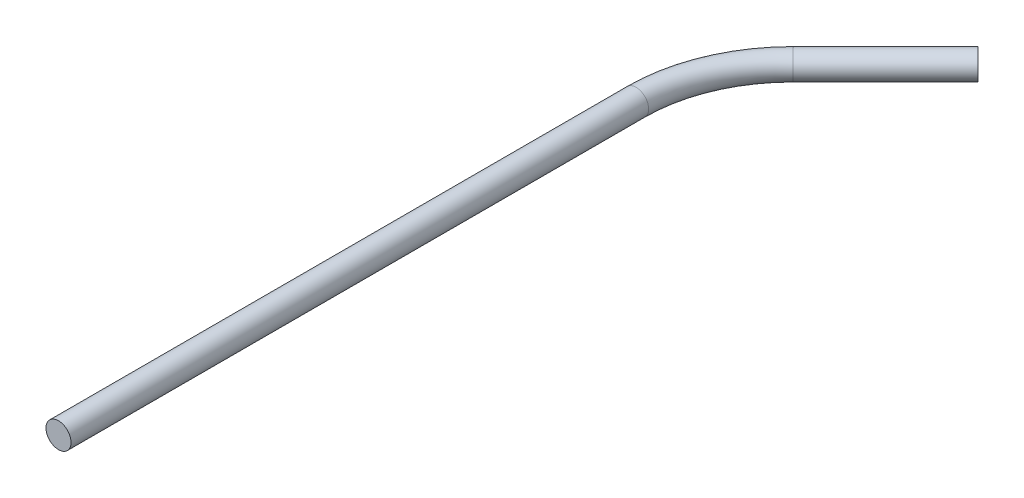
ISO-10303-21;
HEADER;
FILE_DESCRIPTION(('STEP AP214'),'2;1');
FILE_NAME('part.step','',(''),(''),'','','');
FILE_SCHEMA(('AUTOMOTIVE_DESIGN { 1 0 10303 214 1 1 1 1 }'));
ENDSEC;
DATA;
#1=APPLICATION_CONTEXT('core data for automotive mechanical design processes');
#2=APPLICATION_PROTOCOL_DEFINITION('international standard','automotive_design',2000,#1);
#3=PRODUCT_CONTEXT('',#1,'mechanical');
#4=PRODUCT('Part','Part','',(#3));
#5=PRODUCT_RELATED_PRODUCT_CATEGORY('part','',(#4));
#6=PRODUCT_DEFINITION_FORMATION('','',#4);
#7=PRODUCT_DEFINITION_CONTEXT('part definition',#1,'design');
#8=PRODUCT_DEFINITION('design','',#6,#7);
#9=PRODUCT_DEFINITION_SHAPE('','',#8);
#10=(LENGTH_UNIT() NAMED_UNIT(*) SI_UNIT(.MILLI.,.METRE.));
#11=(NAMED_UNIT(*) PLANE_ANGLE_UNIT() SI_UNIT($,.RADIAN.));
#12=(NAMED_UNIT(*) SI_UNIT($,.STERADIAN.) SOLID_ANGLE_UNIT());
#13=UNCERTAINTY_MEASURE_WITH_UNIT(LENGTH_MEASURE(1.E-05),#10,'distance_accuracy_value','');
#14=(GEOMETRIC_REPRESENTATION_CONTEXT(3) GLOBAL_UNCERTAINTY_ASSIGNED_CONTEXT((#13)) GLOBAL_UNIT_ASSIGNED_CONTEXT((#10,
#11,#12)) REPRESENTATION_CONTEXT('',''));
#15=CARTESIAN_POINT('',(0.,0.,0.));
#16=DIRECTION('',(0.,0.,1.));
#17=DIRECTION('',(1.,0.,0.));
#18=AXIS2_PLACEMENT_3D('',#15,#16,#17);
#19=CARTESIAN_POINT('',(2.92893218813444,0.,-43.9289321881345));
#20=DIRECTION('',(0.707106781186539,0.,-0.707106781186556));
#21=DIRECTION('',(-0.707106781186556,0.,-0.707106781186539));
#22=AXIS2_PLACEMENT_3D('',#19,#20,#21);
#23=CYLINDRICAL_SURFACE('',#22,0.8);
#24=CARTESIAN_POINT('',(2.92893218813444,0.,-43.9289321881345));
#25=DIRECTION('',(-0.707106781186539,0.,0.707106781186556));
#26=DIRECTION('',(0.707106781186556,0.,0.707106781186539));
#27=AXIS2_PLACEMENT_3D('',#24,#25,#26);
#28=CIRCLE('',#27,0.8);
#29=CARTESIAN_POINT('',(2.36324676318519,0.,-44.4946176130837));
#30=VERTEX_POINT('',#29);
#31=EDGE_CURVE('E36',#30,#30,#28,.T.);
#32=CARTESIAN_POINT('',(8.83883476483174,0.,-49.838834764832));
#33=DIRECTION('',(-0.707106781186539,0.,0.707106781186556));
#34=DIRECTION('',(0.707106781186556,0.,0.707106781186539));
#35=AXIS2_PLACEMENT_3D('',#32,#33,#34);
#36=CIRCLE('',#35,0.8);
#37=CARTESIAN_POINT('',(8.27314933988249,0.,-50.4045201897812));
#38=VERTEX_POINT('',#37);
#39=EDGE_CURVE('E10',#38,#38,#36,.T.);
#40=CARTESIAN_POINT('',(2.36324676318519,0.,-44.4946176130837));
#41=CARTESIAN_POINT('',(2.42480824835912,0.,-44.5561790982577));
#42=CARTESIAN_POINT('',(2.48636973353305,0.,-44.6177405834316));
#43=CARTESIAN_POINT('',(2.60949270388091,0.,-44.7408635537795));
#44=CARTESIAN_POINT('',(2.67105418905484,0.,-44.8024250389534));
#45=CARTESIAN_POINT('',(2.7941771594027,0.,-44.9255480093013));
#46=CARTESIAN_POINT('',(2.85573864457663,0.,-44.9871094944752));
#47=CARTESIAN_POINT('',(2.97886161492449,0.,-45.1102324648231));
#48=CARTESIAN_POINT('',(3.04042310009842,0.,-45.171793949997));
#49=CARTESIAN_POINT('',(3.16354607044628,0.,-45.2949169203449));
#50=CARTESIAN_POINT('',(3.22510755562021,0.,-45.3564784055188));
#51=CARTESIAN_POINT('',(3.34823052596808,0.,-45.4796013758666));
#52=CARTESIAN_POINT('',(3.40979201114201,0.,-45.5411628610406));
#53=CARTESIAN_POINT('',(3.53291498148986,0.,-45.6642858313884));
#54=CARTESIAN_POINT('',(3.59447646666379,0.,-45.7258473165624));
#55=CARTESIAN_POINT('',(3.71759943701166,0.,-45.8489702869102));
#56=CARTESIAN_POINT('',(3.77916092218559,0.,-45.9105317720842));
#57=CARTESIAN_POINT('',(3.90228389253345,0.,-46.033654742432));
#58=CARTESIAN_POINT('',(3.96384537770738,0.,-46.095216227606));
#59=CARTESIAN_POINT('',(4.08696834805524,0.,-46.2183391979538));
#60=CARTESIAN_POINT('',(4.14852983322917,0.,-46.2799006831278));
#61=CARTESIAN_POINT('',(4.27165280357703,0.,-46.4030236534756));
#62=CARTESIAN_POINT('',(4.33321428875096,0.,-46.4645851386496));
#63=CARTESIAN_POINT('',(4.45633725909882,0.,-46.5877081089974));
#64=CARTESIAN_POINT('',(4.51789874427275,0.,-46.6492695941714));
#65=CARTESIAN_POINT('',(4.64102171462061,0.,-46.7723925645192));
#66=CARTESIAN_POINT('',(4.70258319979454,0.,-46.8339540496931));
#67=CARTESIAN_POINT('',(4.8257061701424,0.,-46.957077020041));
#68=CARTESIAN_POINT('',(4.88726765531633,0.,-47.0186385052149));
#69=CARTESIAN_POINT('',(5.01039062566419,0.,-47.1417614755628));
#70=CARTESIAN_POINT('',(5.07195211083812,0.,-47.2033229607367));
#71=CARTESIAN_POINT('',(5.19507508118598,0.,-47.3264459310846));
#72=CARTESIAN_POINT('',(5.25663656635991,0.,-47.3880074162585));
#73=CARTESIAN_POINT('',(5.37975953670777,0.,-47.5111303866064));
#74=CARTESIAN_POINT('',(5.4413210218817,0.,-47.5726918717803));
#75=CARTESIAN_POINT('',(5.56444399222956,0.,-47.6958148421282));
#76=CARTESIAN_POINT('',(5.62600547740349,0.,-47.7573763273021));
#77=CARTESIAN_POINT('',(5.74912844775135,0.,-47.88049929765));
#78=CARTESIAN_POINT('',(5.81068993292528,0.,-47.9420607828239));
#79=CARTESIAN_POINT('',(5.93381290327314,0.,-48.0651837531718));
#80=CARTESIAN_POINT('',(5.99537438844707,0.,-48.1267452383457));
#81=CARTESIAN_POINT('',(6.11849735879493,0.,-48.2498682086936));
#82=CARTESIAN_POINT('',(6.18005884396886,0.,-48.3114296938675));
#83=CARTESIAN_POINT('',(6.30318181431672,0.,-48.4345526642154));
#84=CARTESIAN_POINT('',(6.36474329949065,0.,-48.4961141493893));
#85=CARTESIAN_POINT('',(6.48786626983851,0.,-48.6192371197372));
#86=CARTESIAN_POINT('',(6.54942775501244,0.,-48.6807986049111));
#87=CARTESIAN_POINT('',(6.6725507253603,0.,-48.803921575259));
#88=CARTESIAN_POINT('',(6.73411221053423,0.,-48.8654830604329));
#89=CARTESIAN_POINT('',(6.85723518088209,0.,-48.9886060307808));
#90=CARTESIAN_POINT('',(6.91879666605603,0.,-49.0501675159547));
#91=CARTESIAN_POINT('',(7.04191963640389,0.,-49.1732904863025));
#92=CARTESIAN_POINT('',(7.10348112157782,0.,-49.2348519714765));
#93=CARTESIAN_POINT('',(7.22660409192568,0.,-49.3579749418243));
#94=CARTESIAN_POINT('',(7.28816557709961,0.,-49.4195364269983));
#95=CARTESIAN_POINT('',(7.41128854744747,0.,-49.5426593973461));
#96=CARTESIAN_POINT('',(7.4728500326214,0.,-49.6042208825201));
#97=CARTESIAN_POINT('',(7.59597300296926,0.,-49.7273438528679));
#98=CARTESIAN_POINT('',(7.65753448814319,0.,-49.7889053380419));
#99=CARTESIAN_POINT('',(7.78065745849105,0.,-49.9120283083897));
#100=CARTESIAN_POINT('',(7.84221894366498,0.,-49.9735897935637));
#101=CARTESIAN_POINT('',(7.96534191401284,0.,-50.0967127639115));
#102=CARTESIAN_POINT('',(8.02690339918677,0.,-50.1582742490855));
#103=CARTESIAN_POINT('',(8.15002636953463,0.,-50.2813972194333));
#104=CARTESIAN_POINT('',(8.21158785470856,0.,-50.3429587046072));
#105=CARTESIAN_POINT('',(8.27314933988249,0.,-50.4045201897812));
#106=B_SPLINE_CURVE_WITH_KNOTS('',3,(#40,#41,#42,#43,#44,#45,#46,#47,#48,#49,#50,#51,#52,#53,
#54,#55,#56,#57,#58,#59,#60,#61,#62,#63,#64,#65,#66,#67,#68,#69,#70,#71,#72,#73,#74,#75,#76,#77,
#78,#79,#80,#81,#82,#83,#84,#85,#86,#87,#88,#89,#90,#91,#92,#93,#94,#95,#96,#97,#98,#99,#100,
#101,#102,#103,#104,#105),.UNSPECIFIED.,.F.,.F.,(4,2,2,2,2,2,2,2,2,2,2,2,2,2,2,2,2,2,2,2,2,2,2,
2,2,2,2,2,2,2,2,2,4),(0.,0.261183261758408,0.52236652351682,0.783549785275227,1.04473304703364,
1.30591630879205,1.56709957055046,1.82828283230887,2.08946609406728,2.35064935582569,
2.6118326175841,2.87301587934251,3.13419914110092,3.39538240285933,3.65656566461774,
3.91774892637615,4.17893218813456,4.44011544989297,4.70129871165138,4.96248197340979,
5.2236652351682,5.48484849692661,5.74603175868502,6.00721502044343,6.26839828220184,
6.52958154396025,6.79076480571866,7.05194806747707,7.31313132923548,7.57431459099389,
7.8354978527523,8.09668111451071,8.35786437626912),.UNSPECIFIED.);
#107=EDGE_CURVE('BSEAM30',#30,#38,#106,.T.);
#108=ORIENTED_EDGE('',*,*,#31,.F.);
#109=ORIENTED_EDGE('',*,*,#39,.T.);
#110=ORIENTED_EDGE('',*,*,#107,.T.);
#111=ORIENTED_EDGE('',*,*,#107,.F.);
#112=EDGE_LOOP('',(#108,#110,#109,#111));
#113=FACE_BOUND('',#112,.T.);
#114=ADVANCED_FACE('F30',(#113),#23,.T.);
#115=CARTESIAN_POINT('',(10.,0.,-36.8578643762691));
#116=DIRECTION('',(0.,-1.,0.));
#117=DIRECTION('',(0.,0.,-1.));
#118=AXIS2_PLACEMENT_3D('',#115,#116,#117);
#119=TOROIDAL_SURFACE('',#118,10.,0.8);
#120=CARTESIAN_POINT('',(0.,0.,-36.8578643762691));
#121=DIRECTION('',(0.,0.,1.));
#122=DIRECTION('',(1.,0.,0.));
#123=AXIS2_PLACEMENT_3D('',#120,#121,#122);
#124=CIRCLE('',#123,0.8);
#125=CARTESIAN_POINT('',(-0.8,0.,-36.8578643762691));
#126=VERTEX_POINT('',#125);
#127=EDGE_CURVE('E40',#126,#126,#124,.T.);
#128=CARTESIAN_POINT('',(10.,0.,-36.8578643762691));
#129=DIRECTION('',(0.,-1.,0.));
#130=DIRECTION('',(0.,0.,-1.));
#131=AXIS2_PLACEMENT_3D('',#128,#129,#130);
#132=CIRCLE('',#131,10.8);
#133=EDGE_CURVE('',#126,#30,#132,.T.);
#134=ORIENTED_EDGE('',*,*,#127,.F.);
#135=ORIENTED_EDGE('',*,*,#31,.T.);
#136=ORIENTED_EDGE('',*,*,#133,.T.);
#137=ORIENTED_EDGE('',*,*,#133,.F.);
#138=EDGE_LOOP('',(#134,#136,#135,#137));
#139=FACE_BOUND('',#138,.T.);
#140=ADVANCED_FACE('F55',(#139),#119,.T.);
#141=CARTESIAN_POINT('',(0.,0.,-36.8578643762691));
#142=DIRECTION('',(0.,0.,1.));
#143=DIRECTION('',(1.,0.,0.));
#144=AXIS2_PLACEMENT_3D('',#141,#142,#143);
#145=CYLINDRICAL_SURFACE('',#144,0.8);
#146=ORIENTED_EDGE('',*,*,#127,.T.);
#147=EDGE_LOOP('',(#146));
#148=FACE_BOUND('',#147,.T.);
#149=CARTESIAN_POINT('',(0.,0.,0.));
#150=DIRECTION('',(0.,0.,1.));
#151=DIRECTION('',(1.,0.,0.));
#152=AXIS2_PLACEMENT_3D('',#149,#150,#151);
#153=CIRCLE('',#152,0.8);
#154=CARTESIAN_POINT('',(0.8,0.,0.));
#155=VERTEX_POINT('',#154);
#156=EDGE_CURVE('E44',#155,#155,#153,.T.);
#157=ORIENTED_EDGE('',*,*,#156,.F.);
#158=EDGE_LOOP('',(#157));
#159=FACE_BOUND('',#158,.T.);
#160=ADVANCED_FACE('F52',(#148,#159),#145,.T.);
#161=CARTESIAN_POINT('',(8.83883476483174,0.,-49.838834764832));
#162=DIRECTION('',(-0.707106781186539,0.,0.707106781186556));
#163=DIRECTION('',(0.707106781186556,0.,0.707106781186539));
#164=AXIS2_PLACEMENT_3D('',#161,#162,#163);
#165=PLANE('',#164);
#166=ORIENTED_EDGE('',*,*,#39,.F.);
#167=EDGE_LOOP('',(#166));
#168=FACE_BOUND('',#167,.T.);
#169=ADVANCED_FACE('F54',(#168),#165,.F.);
#170=CARTESIAN_POINT('',(0.,0.,0.));
#171=DIRECTION('',(0.,0.,1.));
#172=DIRECTION('',(1.,0.,0.));
#173=AXIS2_PLACEMENT_3D('',#170,#171,#172);
#174=PLANE('',#173);
#175=ORIENTED_EDGE('',*,*,#156,.T.);
#176=EDGE_LOOP('',(#175));
#177=FACE_BOUND('',#176,.T.);
#178=ADVANCED_FACE('F50',(#177),#174,.T.);
#179=CLOSED_SHELL('',(#114,#140,#160,#169,#178));
#180=MANIFOLD_SOLID_BREP('B2',#179);
#181=ADVANCED_BREP_SHAPE_REPRESENTATION('',(#18,#180),#14);
#182=SHAPE_DEFINITION_REPRESENTATION(#9,#181);
ENDSEC;
END-ISO-10303-21;
